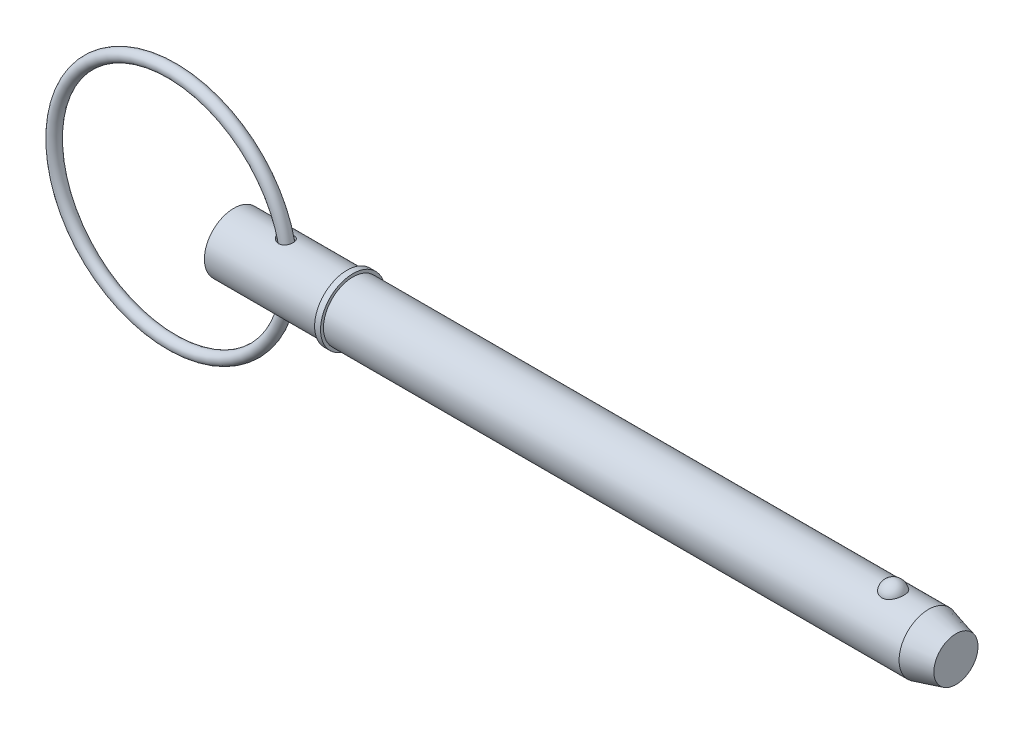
ISO-10303-21;
HEADER;
FILE_DESCRIPTION(('STEP AP214'),'2;1');
FILE_NAME('part.step','',(''),(''),'','','');
FILE_SCHEMA(('AUTOMOTIVE_DESIGN { 1 0 10303 214 1 1 1 1 }'));
ENDSEC;
DATA;
#1=APPLICATION_CONTEXT('core data for automotive mechanical design processes');
#2=APPLICATION_PROTOCOL_DEFINITION('international standard','automotive_design',2000,#1);
#3=PRODUCT_CONTEXT('',#1,'mechanical');
#4=PRODUCT('Part','Part','',(#3));
#5=PRODUCT_RELATED_PRODUCT_CATEGORY('part','',(#4));
#6=PRODUCT_DEFINITION_FORMATION('','',#4);
#7=PRODUCT_DEFINITION_CONTEXT('part definition',#1,'design');
#8=PRODUCT_DEFINITION('design','',#6,#7);
#9=PRODUCT_DEFINITION_SHAPE('','',#8);
#10=(LENGTH_UNIT() NAMED_UNIT(*) SI_UNIT(.MILLI.,.METRE.));
#11=(NAMED_UNIT(*) PLANE_ANGLE_UNIT() SI_UNIT($,.RADIAN.));
#12=(NAMED_UNIT(*) SI_UNIT($,.STERADIAN.) SOLID_ANGLE_UNIT());
#13=UNCERTAINTY_MEASURE_WITH_UNIT(LENGTH_MEASURE(1.E-05),#10,'distance_accuracy_value','');
#14=(GEOMETRIC_REPRESENTATION_CONTEXT(3) GLOBAL_UNCERTAINTY_ASSIGNED_CONTEXT((#13)) GLOBAL_UNIT_ASSIGNED_CONTEXT((#10,
#11,#12)) REPRESENTATION_CONTEXT('',''));
#15=CARTESIAN_POINT('',(0.,0.,0.));
#16=DIRECTION('',(0.,0.,1.));
#17=DIRECTION('',(1.,0.,0.));
#18=AXIS2_PLACEMENT_3D('',#15,#16,#17);
#19=CARTESIAN_POINT('',(-13.3798047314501,0.,0.));
#20=DIRECTION('',(0.,0.,1.));
#21=DIRECTION('',(1.,0.,0.));
#22=AXIS2_PLACEMENT_3D('',#19,#20,#21);
#23=TOROIDAL_SURFACE('',#22,25.4,1.27);
#24=CARTESIAN_POINT('',(13.2901952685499,0.,0.));
#25=VERTEX_POINT('',#24);
#26=VERTEX_LOOP('',#25);
#27=FACE_BOUND('',#26,.T.);
#28=ADVANCED_FACE('P0_F12',(#27),#23,.T.);
#29=CLOSED_SHELL('',(#28));
#30=MANIFOLD_SOLID_BREP('P0_B1',#29);
#31=CARTESIAN_POINT('',(0.,0.,0.));
#32=DIRECTION('',(1.,0.,0.));
#33=DIRECTION('',(0.,0.,-1.));
#34=AXIS2_PLACEMENT_3D('',#31,#32,#33);
#35=CYLINDRICAL_SURFACE('',#34,6.35);
#36=CARTESIAN_POINT('',(9.67500140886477,6.32698634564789,-0.540133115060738));
#37=CARTESIAN_POINT('',(9.70878953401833,6.3197498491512,-0.624879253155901));
#38=CARTESIAN_POINT('',(9.75028044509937,6.31105328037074,-0.706504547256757));
#39=CARTESIAN_POINT('',(9.84659255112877,6.29180070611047,-0.861319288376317));
#40=CARTESIAN_POINT('',(9.90144039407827,6.28124099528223,-0.934491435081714));
#41=CARTESIAN_POINT('',(10.021999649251,6.25949497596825,-1.0704877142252));
#42=CARTESIAN_POINT('',(10.0876589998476,6.2483118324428,-1.1333586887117));
#43=CARTESIAN_POINT('',(10.2280180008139,6.22641783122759,-1.24805262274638));
#44=CARTESIAN_POINT('',(10.3027159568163,6.21570688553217,-1.29987764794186));
#45=CARTESIAN_POINT('',(10.4650889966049,6.19509606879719,-1.39492899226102));
#46=CARTESIAN_POINT('',(10.5533142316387,6.1853135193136,-1.4372443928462));
#47=CARTESIAN_POINT('',(10.7357818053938,6.16871128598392,-1.50691441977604));
#48=CARTESIAN_POINT('',(10.8300253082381,6.16189217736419,-1.53426614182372));
#49=CARTESIAN_POINT('',(11.0227953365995,6.15211299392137,-1.57302798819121));
#50=CARTESIAN_POINT('',(11.1213511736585,6.14918579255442,-1.58430237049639));
#51=CARTESIAN_POINT('',(11.3189518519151,6.1478413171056,-1.58951619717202));
#52=CARTESIAN_POINT('',(11.417996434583,6.14942187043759,-1.58346399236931));
#53=CARTESIAN_POINT('',(11.6070859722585,6.15678569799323,-1.55457003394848));
#54=CARTESIAN_POINT('',(11.6973059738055,6.16229943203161,-1.53280404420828));
#55=CARTESIAN_POINT('',(11.8723373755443,6.176630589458,-1.4739892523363));
#56=CARTESIAN_POINT('',(11.9571502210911,6.185447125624,-1.43694455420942));
#57=CARTESIAN_POINT('',(12.1146737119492,6.20482821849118,-1.3507217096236));
#58=CARTESIAN_POINT('',(12.1877743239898,6.21528554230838,-1.30222952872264));
#59=CARTESIAN_POINT('',(12.324618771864,6.23705116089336,-1.19362916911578));
#60=CARTESIAN_POINT('',(12.3883628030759,6.24835943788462,-1.1335212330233));
#61=CARTESIAN_POINT('',(12.5046662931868,6.27053957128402,-1.00357204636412));
#62=CARTESIAN_POINT('',(12.5572571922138,6.28141258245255,-0.933759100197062));
#63=CARTESIAN_POINT('',(12.6502125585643,6.30157953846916,-0.786214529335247));
#64=CARTESIAN_POINT('',(12.6905764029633,6.31087340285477,-0.708482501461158));
#65=CARTESIAN_POINT('',(12.7585531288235,6.32699259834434,-0.546246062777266));
#66=CARTESIAN_POINT('',(12.7860022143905,6.33378599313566,-0.461669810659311));
#67=CARTESIAN_POINT('',(12.8267605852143,6.34401050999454,-0.288980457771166));
#68=CARTESIAN_POINT('',(12.8400695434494,6.34744155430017,-0.200867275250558));
#69=CARTESIAN_POINT('',(12.8522644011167,6.35058177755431,-0.0231943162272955));
#70=CARTESIAN_POINT('',(12.8510870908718,6.35027464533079,0.0663700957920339));
#71=CARTESIAN_POINT('',(12.8341831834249,6.34593169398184,0.244024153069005));
#72=CARTESIAN_POINT('',(12.8184563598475,6.341895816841,0.332113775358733));
#73=CARTESIAN_POINT('',(12.7728208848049,6.33052992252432,0.504322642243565));
#74=CARTESIAN_POINT('',(12.7429114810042,6.32319973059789,0.588441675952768));
#75=CARTESIAN_POINT('',(12.6696162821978,6.30604116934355,0.750316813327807));
#76=CARTESIAN_POINT('',(12.6262302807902,6.29621276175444,0.828072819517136));
#77=CARTESIAN_POINT('',(12.5270856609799,6.27515240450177,0.974918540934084));
#78=CARTESIAN_POINT('',(12.4713403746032,6.26392197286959,1.04401746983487));
#79=CARTESIAN_POINT('',(12.3488662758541,6.24131002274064,1.1716478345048));
#80=CARTESIAN_POINT('',(12.2821384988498,6.22992851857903,1.23018026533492));
#81=CARTESIAN_POINT('',(12.1401870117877,6.20841765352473,1.33449214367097));
#82=CARTESIAN_POINT('',(12.0650507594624,6.19827734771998,1.38038832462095));
#83=CARTESIAN_POINT('',(11.9079044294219,6.18026478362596,1.45892404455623));
#84=CARTESIAN_POINT('',(11.8258951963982,6.17239224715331,1.49156520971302));
#85=CARTESIAN_POINT('',(11.6581736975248,6.15982613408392,1.54263810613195));
#86=CARTESIAN_POINT('',(11.572502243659,6.15510409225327,1.56119728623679));
#87=CARTESIAN_POINT('',(11.3991899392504,6.14916283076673,1.58443707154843));
#88=CARTESIAN_POINT('',(11.3115488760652,6.14794399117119,1.58911617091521));
#89=CARTESIAN_POINT('',(11.1345547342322,6.14904466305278,1.58485137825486));
#90=CARTESIAN_POINT('',(11.0452104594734,6.15144894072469,1.5755811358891));
#91=CARTESIAN_POINT('',(10.8691479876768,6.15957601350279,1.54349959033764));
#92=CARTESIAN_POINT('',(10.782430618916,6.16529984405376,1.52068406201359));
#93=CARTESIAN_POINT('',(10.6082848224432,6.17983892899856,1.4605156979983));
#94=CARTESIAN_POINT('',(10.5211557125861,6.1888262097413,1.42233764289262));
#95=CARTESIAN_POINT('',(10.3542377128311,6.20874782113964,1.33268652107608));
#96=CARTESIAN_POINT('',(10.2744521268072,6.21968302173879,1.28120750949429));
#97=CARTESIAN_POINT('',(10.120854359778,6.24282707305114,1.16334748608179));
#98=CARTESIAN_POINT('',(10.0474902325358,6.25507146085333,1.09638652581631));
#99=CARTESIAN_POINT('',(9.91368693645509,6.27890019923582,0.950453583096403));
#100=CARTESIAN_POINT('',(9.85324511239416,6.29048468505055,0.87148407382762));
#101=CARTESIAN_POINT('',(9.75037543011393,6.31102161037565,0.707140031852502));
#102=CARTESIAN_POINT('',(9.70726585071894,6.32006820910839,0.622206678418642));
#103=CARTESIAN_POINT('',(9.63775895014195,6.33497125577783,0.445490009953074));
#104=CARTESIAN_POINT('',(9.61134627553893,6.34083063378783,0.35371307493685));
#105=CARTESIAN_POINT('',(9.57891955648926,6.34807071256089,0.177220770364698));
#106=CARTESIAN_POINT('',(9.5709352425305,6.3498832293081,0.0928817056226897));
#107=CARTESIAN_POINT('',(9.56994851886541,6.35010532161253,-0.0758268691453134));
#108=CARTESIAN_POINT('',(9.57692695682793,6.34851924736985,-0.160196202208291));
#109=CARTESIAN_POINT('',(9.59985709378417,6.34339435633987,-0.294043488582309));
#110=CARTESIAN_POINT('',(9.61128951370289,6.34084912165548,-0.34438537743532));
#111=CARTESIAN_POINT('',(9.63933183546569,6.33468615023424,-0.443526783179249));
#112=CARTESIAN_POINT('',(9.65594100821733,6.33106856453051,-0.492326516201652));
#113=CARTESIAN_POINT('',(9.67500140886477,6.32698634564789,-0.540133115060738));
#114=B_SPLINE_CURVE_WITH_KNOTS('',3,(#36,#37,#38,#39,#40,#41,#42,#43,#44,#45,#46,#47,#48,#49,
#50,#51,#52,#53,#54,#55,#56,#57,#58,#59,#60,#61,#62,#63,#64,#65,#66,#67,#68,#69,#70,#71,#72,#73,
#74,#75,#76,#77,#78,#79,#80,#81,#82,#83,#84,#85,#86,#87,#88,#89,#90,#91,#92,#93,#94,#95,#96,#97,
#98,#99,#100,#101,#102,#103,#104,#105,#106,#107,#108,#109,#110,#111,#112,#113),.UNSPECIFIED.,
.T.,.F.,(4,2,2,2,2,2,2,2,2,2,2,2,2,2,2,2,2,2,2,2,2,2,2,2,2,2,2,2,2,2,2,2,2,2,2,2,2,2,4),(0.,
0.274348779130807,0.54924945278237,0.822863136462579,1.09642560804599,1.3900770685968,
1.68378550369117,1.97995934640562,2.27599046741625,2.55347281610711,2.83088067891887,
3.09465189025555,3.35841759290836,3.62142956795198,3.88445494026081,4.1507318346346,
4.4170148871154,4.68446025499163,4.95190978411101,5.21937350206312,5.48684131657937,
5.75402200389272,6.02117751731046,6.28577524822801,6.55034050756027,6.81248178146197,
7.0746514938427,7.34305086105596,7.61153399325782,7.89692981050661,8.18245340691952,
8.48120635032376,8.77989784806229,9.06530254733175,9.35044442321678,9.60331609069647,
9.85586427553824,10.010650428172,10.1654147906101),.UNSPECIFIED.);
#115=CARTESIAN_POINT('',(9.67500140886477,6.32698634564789,-0.540133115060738));
#116=VERTEX_POINT('',#115);
#117=EDGE_CURVE('P1_E42',#116,#116,#114,.T.);
#118=ORIENTED_EDGE('',*,*,#117,.T.);
#119=EDGE_LOOP('',(#118));
#120=FACE_BOUND('',#119,.T.);
#121=CARTESIAN_POINT('',(0.,0.,0.));
#122=DIRECTION('',(1.,0.,0.));
#123=DIRECTION('',(0.,0.,-1.));
#124=AXIS2_PLACEMENT_3D('',#121,#122,#123);
#125=CIRCLE('',#124,6.35);
#126=CARTESIAN_POINT('',(0.,0.,-6.35));
#127=VERTEX_POINT('',#126);
#128=EDGE_CURVE('P1_E9',#127,#127,#125,.T.);
#129=ORIENTED_EDGE('',*,*,#128,.T.);
#130=EDGE_LOOP('',(#129));
#131=FACE_BOUND('',#130,.T.);
#132=CARTESIAN_POINT('',(24.43,0.,0.));
#133=DIRECTION('',(1.,0.,0.));
#134=DIRECTION('',(0.,0.,-1.));
#135=AXIS2_PLACEMENT_3D('',#132,#133,#134);
#136=CIRCLE('',#135,6.35);
#137=CARTESIAN_POINT('',(24.43,0.,-6.35));
#138=VERTEX_POINT('',#137);
#139=EDGE_CURVE('P1_E25',#138,#138,#136,.T.);
#140=ORIENTED_EDGE('',*,*,#139,.F.);
#141=EDGE_LOOP('',(#140));
#142=FACE_BOUND('',#141,.T.);
#143=CARTESIAN_POINT('',(9.67500140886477,-6.32698634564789,-0.540133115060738));
#144=CARTESIAN_POINT('',(9.64544894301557,-6.33331515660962,-0.46600258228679));
#145=CARTESIAN_POINT('',(9.62177180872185,-6.33852974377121,-0.389437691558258));
#146=CARTESIAN_POINT('',(9.58727043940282,-6.34619174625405,-0.233330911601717));
#147=CARTESIAN_POINT('',(9.57644043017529,-6.34864040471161,-0.153790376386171));
#148=CARTESIAN_POINT('',(9.56819517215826,-6.3505010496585,0.00612071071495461));
#149=CARTESIAN_POINT('',(9.57079639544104,-6.34990930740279,0.0864921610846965));
#150=CARTESIAN_POINT('',(9.58930797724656,-6.3457478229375,0.245607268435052));
#151=CARTESIAN_POINT('',(9.60522046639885,-6.34217760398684,0.324350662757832));
#152=CARTESIAN_POINT('',(9.64931570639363,-6.3324977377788,0.47727605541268));
#153=CARTESIAN_POINT('',(9.67737525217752,-6.32641361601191,0.551495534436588));
#154=CARTESIAN_POINT('',(9.74451510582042,-6.31231128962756,0.69455132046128));
#155=CARTESIAN_POINT('',(9.78359827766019,-6.30429258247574,0.763386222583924));
#156=CARTESIAN_POINT('',(9.87474700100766,-6.28638332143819,0.899414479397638));
#157=CARTESIAN_POINT('',(9.92757481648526,-6.27639669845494,0.966083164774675));
#158=CARTESIAN_POINT('',(10.042675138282,-6.25596164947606,1.09061181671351));
#159=CARTESIAN_POINT('',(10.1049521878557,-6.24551300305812,1.14846751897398));
#160=CARTESIAN_POINT('',(10.2445505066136,-6.22397505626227,1.26024641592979));
#161=CARTESIAN_POINT('',(10.3227711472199,-6.2129394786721,1.31305951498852));
#162=CARTESIAN_POINT('',(10.4867924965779,-6.19263757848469,1.40570084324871));
#163=CARTESIAN_POINT('',(10.5725962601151,-6.18337197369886,1.44552380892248));
#164=CARTESIAN_POINT('',(10.7543302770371,-6.16725983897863,1.51283687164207));
#165=CARTESIAN_POINT('',(10.8505554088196,-6.16056505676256,1.53957358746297));
#166=CARTESIAN_POINT('',(11.0463546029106,-6.15127671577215,1.57628137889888));
#167=CARTESIAN_POINT('',(11.1459276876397,-6.14868197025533,1.58625730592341));
#168=CARTESIAN_POINT('',(11.3414257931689,-6.14810798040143,1.58848000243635));
#169=CARTESIAN_POINT('',(11.4373417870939,-6.14995283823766,1.58140242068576));
#170=CARTESIAN_POINT('',(11.6262783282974,-6.1577972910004,1.55057566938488));
#171=CARTESIAN_POINT('',(11.719300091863,-6.16379511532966,1.52683360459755));
#172=CARTESIAN_POINT('',(11.8934223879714,-6.17873566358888,1.46514575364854));
#173=CARTESIAN_POINT('',(11.9749048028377,-6.18746207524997,1.42822144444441));
#174=CARTESIAN_POINT('',(12.1301362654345,-6.20693584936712,1.34105645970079));
#175=CARTESIAN_POINT('',(12.2038861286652,-6.21768299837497,1.29081719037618));
#176=CARTESIAN_POINT('',(12.3399792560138,-6.23970077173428,1.17972764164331));
#177=CARTESIAN_POINT('',(12.4025430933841,-6.25095401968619,1.11914355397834));
#178=CARTESIAN_POINT('',(12.5166805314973,-6.27296916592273,0.988307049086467));
#179=CARTESIAN_POINT('',(12.568253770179,-6.28373104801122,0.918054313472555));
#180=CARTESIAN_POINT('',(12.6596230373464,-6.3037060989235,0.769081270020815));
#181=CARTESIAN_POINT('',(12.6992956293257,-6.31290263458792,0.690283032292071));
#182=CARTESIAN_POINT('',(12.7652258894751,-6.32862394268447,0.527011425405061));
#183=CARTESIAN_POINT('',(12.7914829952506,-6.33514860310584,0.442537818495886));
#184=CARTESIAN_POINT('',(12.8301436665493,-6.34487485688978,0.269505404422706));
#185=CARTESIAN_POINT('',(12.8424230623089,-6.34804664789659,0.180917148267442));
#186=CARTESIAN_POINT('',(12.8524214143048,-6.35062347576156,0.00286829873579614));
#187=CARTESIAN_POINT('',(12.8501402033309,-6.35002846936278,-0.0865923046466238));
#188=CARTESIAN_POINT('',(12.8310619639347,-6.34513332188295,-0.263931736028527));
#189=CARTESIAN_POINT('',(12.8142517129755,-6.34082980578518,-0.35180904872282));
#190=CARTESIAN_POINT('',(12.7664911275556,-6.32897674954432,-0.523406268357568));
#191=CARTESIAN_POINT('',(12.7355404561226,-6.3214271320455,-0.607126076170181));
#192=CARTESIAN_POINT('',(12.6602298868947,-6.30390232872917,-0.768030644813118));
#193=CARTESIAN_POINT('',(12.6158695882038,-6.29392707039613,-0.845215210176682));
#194=CARTESIAN_POINT('',(12.5148171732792,-6.2726521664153,-0.990836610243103));
#195=CARTESIAN_POINT('',(12.4581254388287,-6.26135256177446,-1.05927371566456));
#196=CARTESIAN_POINT('',(12.33416419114,-6.2387572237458,-1.18510935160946));
#197=CARTESIAN_POINT('',(12.2669484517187,-6.22746174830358,-1.24256086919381));
#198=CARTESIAN_POINT('',(12.1235592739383,-6.20610255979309,-1.34519464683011));
#199=CARTESIAN_POINT('',(12.0473871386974,-6.19603866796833,-1.39037868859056));
#200=CARTESIAN_POINT('',(11.8892714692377,-6.17839642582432,-1.46678006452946));
#201=CARTESIAN_POINT('',(11.8074126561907,-6.17078838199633,-1.49816605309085));
#202=CARTESIAN_POINT('',(11.6394563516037,-6.15869606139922,-1.54712759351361));
#203=CARTESIAN_POINT('',(11.5533589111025,-6.15421174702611,-1.56470331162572));
#204=CARTESIAN_POINT('',(11.3789660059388,-6.14876652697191,-1.58596734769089));
#205=CARTESIAN_POINT('',(11.2906621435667,-6.1478222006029,-1.58959032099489));
#206=CARTESIAN_POINT('',(11.1146029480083,-6.149490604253,-1.58312110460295));
#207=CARTESIAN_POINT('',(11.0268477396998,-6.1521041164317,-1.57302589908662));
#208=CARTESIAN_POINT('',(10.8498668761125,-6.16071031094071,-1.53898332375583));
#209=CARTESIAN_POINT('',(10.7607726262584,-6.16685908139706,-1.51439468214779));
#210=CARTESIAN_POINT('',(10.5876521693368,-6.18189031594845,-1.45181305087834));
#211=CARTESIAN_POINT('',(10.5036282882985,-6.19077402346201,-1.41381396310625));
#212=CARTESIAN_POINT('',(10.3374228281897,-6.2109378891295,-1.32252480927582));
#213=CARTESIAN_POINT('',(10.255708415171,-6.2223355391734,-1.26840756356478));
#214=CARTESIAN_POINT('',(10.1025645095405,-6.24580740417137,-1.14725208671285));
#215=CARTESIAN_POINT('',(10.0311354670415,-6.25788164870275,-1.08021329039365));
#216=CARTESIAN_POINT('',(9.90472699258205,-6.2806176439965,-0.938710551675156));
#217=CARTESIAN_POINT('',(9.84904456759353,-6.29132066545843,-0.864883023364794));
#218=CARTESIAN_POINT('',(9.75129345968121,-6.31084098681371,-0.708496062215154));
#219=CARTESIAN_POINT('',(9.70921094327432,-6.31966019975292,-0.625945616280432));
#220=CARTESIAN_POINT('',(9.67500140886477,-6.32698634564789,-0.540133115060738));
#221=B_SPLINE_CURVE_WITH_KNOTS('',3,(#143,#144,#145,#146,#147,#148,#149,#150,#151,#152,#153,
#154,#155,#156,#157,#158,#159,#160,#161,#162,#163,#164,#165,#166,#167,#168,#169,#170,#171,#172,
#173,#174,#175,#176,#177,#178,#179,#180,#181,#182,#183,#184,#185,#186,#187,#188,#189,#190,#191,
#192,#193,#194,#195,#196,#197,#198,#199,#200,#201,#202,#203,#204,#205,#206,#207,#208,#209,#210,
#211,#212,#213,#214,#215,#216,#217,#218,#219,#220),.UNSPECIFIED.,.T.,.F.,(4,2,2,2,2,2,2,2,2,2,2,
2,2,2,2,2,2,2,2,2,2,2,2,2,2,2,2,2,2,2,2,2,2,2,2,2,2,2,4),(0.,0.239871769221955,
0.479635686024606,0.719693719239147,0.959790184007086,1.19750645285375,1.43528453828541,
1.69117930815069,1.94719750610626,2.23102979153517,2.51497694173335,2.81376497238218,
3.11246650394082,3.39952951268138,3.68647020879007,3.95479420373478,4.22308987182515,
4.48530700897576,4.74753278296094,5.01239119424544,5.27726070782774,5.54446524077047,
5.81167284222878,6.07912387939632,6.34658129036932,6.61404669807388,6.88150382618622,
7.1476364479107,7.41373039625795,7.67647472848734,7.93921589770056,8.20318607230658,
8.46721428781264,8.74390821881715,9.02072813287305,9.31537622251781,9.61003720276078,
9.88799314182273,10.1656654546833),.UNSPECIFIED.);
#222=CARTESIAN_POINT('',(9.67500140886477,-6.32698634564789,-0.540133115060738));
#223=VERTEX_POINT('',#222);
#224=EDGE_CURVE('P1_E17',#223,#223,#221,.T.);
#225=ORIENTED_EDGE('',*,*,#224,.T.);
#226=EDGE_LOOP('',(#225));
#227=FACE_BOUND('',#226,.T.);
#228=ADVANCED_FACE('P1_F13',(#120,#131,#142,#227),#35,.T.);
#229=CARTESIAN_POINT('',(0.,0.,0.));
#230=DIRECTION('',(1.,0.,0.));
#231=DIRECTION('',(0.,0.,-1.));
#232=AXIS2_PLACEMENT_3D('',#229,#230,#231);
#233=CYLINDRICAL_SURFACE('',#232,6.35);
#234=CARTESIAN_POINT('',(149.955369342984,0.,0.));
#235=DIRECTION('',(1.,0.,0.));
#236=DIRECTION('',(0.,0.,-1.));
#237=AXIS2_PLACEMENT_3D('',#234,#235,#236);
#238=CIRCLE('',#237,6.35);
#239=CARTESIAN_POINT('',(149.955369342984,0.,-6.35));
#240=VERTEX_POINT('',#239);
#241=EDGE_CURVE('P1_E99',#240,#240,#238,.T.);
#242=ORIENTED_EDGE('',*,*,#241,.F.);
#243=EDGE_LOOP('',(#242));
#244=FACE_BOUND('',#243,.T.);
#245=CARTESIAN_POINT('',(25.7,0.,0.));
#246=DIRECTION('',(1.,0.,0.));
#247=DIRECTION('',(0.,0.,-1.));
#248=AXIS2_PLACEMENT_3D('',#245,#246,#247);
#249=CIRCLE('',#248,6.35);
#250=CARTESIAN_POINT('',(25.7,0.,-6.35));
#251=VERTEX_POINT('',#250);
#252=EDGE_CURVE('P1_E96',#251,#251,#249,.T.);
#253=ORIENTED_EDGE('',*,*,#252,.T.);
#254=EDGE_LOOP('',(#253));
#255=FACE_BOUND('',#254,.T.);
#256=CARTESIAN_POINT('',(142.330021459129,5.87502187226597,2.40969251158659));
#257=CARTESIAN_POINT('',(142.205030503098,5.87501645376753,2.40969773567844));
#258=CARTESIAN_POINT('',(142.080080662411,5.87916061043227,2.39967292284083));
#259=CARTESIAN_POINT('',(141.833909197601,5.8952311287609,2.35991730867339));
#260=CARTESIAN_POINT('',(141.712686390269,5.90715499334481,2.33019283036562));
#261=CARTESIAN_POINT('',(141.477517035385,5.93739567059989,2.25201402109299));
#262=CARTESIAN_POINT('',(141.363560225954,5.95570321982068,2.20358681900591));
#263=CARTESIAN_POINT('',(141.14557352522,5.99672067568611,2.08937987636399));
#264=CARTESIAN_POINT('',(141.041545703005,6.01943149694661,2.02359652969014));
#265=CARTESIAN_POINT('',(140.842943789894,6.06760647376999,1.87428969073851));
#266=CARTESIAN_POINT('',(140.748726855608,6.09313095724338,1.79031110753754));
#267=CARTESIAN_POINT('',(140.575255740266,6.14375873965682,1.60800178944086));
#268=CARTESIAN_POINT('',(140.496004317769,6.16886196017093,1.50966841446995));
#269=CARTESIAN_POINT('',(140.350845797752,6.21724600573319,1.29645884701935));
#270=CARTESIAN_POINT('',(140.285688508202,6.24039621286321,1.18104158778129));
#271=CARTESIAN_POINT('',(140.174703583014,6.28117277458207,0.940351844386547));
#272=CARTESIAN_POINT('',(140.128877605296,6.29879865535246,0.815078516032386));
#273=CARTESIAN_POINT('',(140.057023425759,6.32692073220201,0.556494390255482));
#274=CARTESIAN_POINT('',(140.031249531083,6.33732517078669,0.423102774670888));
#275=CARTESIAN_POINT('',(140.000988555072,6.34957673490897,0.153542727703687));
#276=CARTESIAN_POINT('',(139.996500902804,6.35142408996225,0.0173743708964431));
#277=CARTESIAN_POINT('',(140.008865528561,6.34638925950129,-0.253036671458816));
#278=CARTESIAN_POINT('',(140.025594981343,6.33955731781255,-0.38728593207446));
#279=CARTESIAN_POINT('',(140.079843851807,6.31794129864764,-0.650851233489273));
#280=CARTESIAN_POINT('',(140.117363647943,6.30315707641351,-0.780167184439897));
#281=CARTESIAN_POINT('',(140.212500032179,6.26711642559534,-1.03041949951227));
#282=CARTESIAN_POINT('',(140.270143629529,6.24585130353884,-1.1513443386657));
#283=CARTESIAN_POINT('',(140.404352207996,6.19905619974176,-1.38129800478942));
#284=CARTESIAN_POINT('',(140.480918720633,6.17352587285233,-1.49032586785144));
#285=CARTESIAN_POINT('',(140.651753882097,6.12080227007,-1.69393164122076));
#286=CARTESIAN_POINT('',(140.746100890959,6.09360200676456,-1.78844209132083));
#287=CARTESIAN_POINT('',(140.950119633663,6.04070434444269,-1.95970536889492));
#288=CARTESIAN_POINT('',(141.059790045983,6.01500681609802,-2.03645972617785));
#289=CARTESIAN_POINT('',(141.289187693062,5.96867714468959,-2.16845644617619));
#290=CARTESIAN_POINT('',(141.408652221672,5.94794910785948,-2.22412062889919));
#291=CARTESIAN_POINT('',(141.656218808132,5.91340580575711,-2.31440992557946));
#292=CARTESIAN_POINT('',(141.784317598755,5.8995879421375,-2.3490429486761));
#293=CARTESIAN_POINT('',(142.038582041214,5.88111049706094,-2.39491590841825));
#294=CARTESIAN_POINT('',(142.164520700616,5.876025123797,-2.40724512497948));
#295=CARTESIAN_POINT('',(142.416786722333,5.87428980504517,-2.41147867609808));
#296=CARTESIAN_POINT('',(142.543114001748,5.87763817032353,-2.40338710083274));
#297=CARTESIAN_POINT('',(142.788417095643,5.89212921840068,-2.367627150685));
#298=CARTESIAN_POINT('',(142.907499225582,5.90302431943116,-2.34058030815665));
#299=CARTESIAN_POINT('',(143.13924472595,5.93113752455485,-2.26839066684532));
#300=CARTESIAN_POINT('',(143.251907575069,5.94835614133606,-2.22324640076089));
#301=CARTESIAN_POINT('',(143.470400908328,5.98773016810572,-2.11493806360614));
#302=CARTESIAN_POINT('',(143.576028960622,6.00998499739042,-2.05140269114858));
#303=CARTESIAN_POINT('',(143.775300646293,6.05690144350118,-1.90842705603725));
#304=CARTESIAN_POINT('',(143.868941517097,6.08156361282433,-1.82898313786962));
#305=CARTESIAN_POINT('',(144.046675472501,6.13211715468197,-1.65182429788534));
#306=CARTESIAN_POINT('',(144.130055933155,6.15800825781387,-1.55339381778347));
#307=CARTESIAN_POINT('',(144.279790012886,6.20712834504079,-1.34374214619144));
#308=CARTESIAN_POINT('',(144.346140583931,6.23035685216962,-1.23251867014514));
#309=CARTESIAN_POINT('',(144.462345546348,6.27251177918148,-0.996447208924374));
#310=CARTESIAN_POINT('',(144.511607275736,6.29127762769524,-0.871278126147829));
#311=CARTESIAN_POINT('',(144.589614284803,6.3215862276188,-0.6138701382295));
#312=CARTESIAN_POINT('',(144.618359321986,6.33312889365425,-0.481631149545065));
#313=CARTESIAN_POINT('',(144.65477058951,6.34782349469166,-0.213672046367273));
#314=CARTESIAN_POINT('',(144.662413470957,6.35096613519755,-0.0779482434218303));
#315=CARTESIAN_POINT('',(144.656395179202,6.34851322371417,0.192943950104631));
#316=CARTESIAN_POINT('',(144.642734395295,6.3429178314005,0.328112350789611));
#317=CARTESIAN_POINT('',(144.59450361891,6.32360512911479,0.593406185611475));
#318=CARTESIAN_POINT('',(144.560031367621,6.30992579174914,0.723552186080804));
#319=CARTESIAN_POINT('',(144.470953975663,6.27586325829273,0.97583417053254));
#320=CARTESIAN_POINT('',(144.41634761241,6.25547965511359,1.09796966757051));
#321=CARTESIAN_POINT('',(144.28775879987,6.20998183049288,1.33148921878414));
#322=CARTESIAN_POINT('',(144.213674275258,6.18484288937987,1.44281227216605));
#323=CARTESIAN_POINT('',(144.047820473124,6.13258735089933,1.65087683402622));
#324=CARTESIAN_POINT('',(143.956051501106,6.10547078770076,1.74761859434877));
#325=CARTESIAN_POINT('',(143.757183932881,6.05235879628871,1.92350926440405));
#326=CARTESIAN_POINT('',(143.650133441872,6.0263601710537,2.00271146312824));
#327=CARTESIAN_POINT('',(143.423138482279,5.97843747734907,2.1415415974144));
#328=CARTESIAN_POINT('',(143.303191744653,5.95651412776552,2.20116608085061));
#329=CARTESIAN_POINT('',(143.044523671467,5.91812106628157,2.30250570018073));
#330=CARTESIAN_POINT('',(142.90506980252,5.90217533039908,2.34256795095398));
#331=CARTESIAN_POINT('',(142.620397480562,5.88063128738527,2.39615214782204));
#332=CARTESIAN_POINT('',(142.47518174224,5.8750281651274,2.40968644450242));
#333=CARTESIAN_POINT('',(142.330021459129,5.87502187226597,2.40969251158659));
#334=B_SPLINE_CURVE_WITH_KNOTS('',3,(#256,#257,#258,#259,#260,#261,#262,#263,#264,#265,#266,
#267,#268,#269,#270,#271,#272,#273,#274,#275,#276,#277,#278,#279,#280,#281,#282,#283,#284,#285,
#286,#287,#288,#289,#290,#291,#292,#293,#294,#295,#296,#297,#298,#299,#300,#301,#302,#303,#304,
#305,#306,#307,#308,#309,#310,#311,#312,#313,#314,#315,#316,#317,#318,#319,#320,#321,#322,#323,
#324,#325,#326,#327,#328,#329,#330,#331,#332,#333),.UNSPECIFIED.,.T.,.F.,(4,2,2,2,2,2,2,2,2,2,2,
2,2,2,2,2,2,2,2,2,2,2,2,2,2,2,2,2,2,2,2,2,2,2,2,2,2,2,4),(0.,0.374440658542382,
0.748761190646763,1.12254078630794,1.49639810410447,1.88098871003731,2.2656501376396,
2.66741104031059,3.06920639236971,3.47601794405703,3.88281858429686,4.28727498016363,
4.69173873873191,5.09674745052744,5.50178895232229,5.9086591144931,6.31549420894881,
6.71369855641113,7.11175305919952,7.48978077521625,7.86773278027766,8.23383886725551,
8.59997464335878,8.9740904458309,9.34829231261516,9.7412266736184,10.1342313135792,
10.5397522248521,10.9452779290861,11.3512521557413,11.7572189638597,12.1612938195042,
12.5653932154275,12.9716540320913,13.3779078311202,13.7829098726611,14.1879832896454,
14.6230486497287,15.0579114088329),.UNSPECIFIED.);
#335=CARTESIAN_POINT('',(142.330021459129,5.87502187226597,2.40969251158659));
#336=VERTEX_POINT('',#335);
#337=EDGE_CURVE('P1_E34',#336,#336,#334,.T.);
#338=ORIENTED_EDGE('',*,*,#337,.T.);
#339=EDGE_LOOP('',(#338));
#340=FACE_BOUND('',#339,.T.);
#341=ADVANCED_FACE('P1_F46',(#244,#255,#340),#233,.T.);
#342=CARTESIAN_POINT('',(0.,0.,0.));
#343=DIRECTION('',(-1.,0.,0.));
#344=DIRECTION('',(0.,0.,1.));
#345=AXIS2_PLACEMENT_3D('',#342,#343,#344);
#346=PLANE('',#345);
#347=ORIENTED_EDGE('',*,*,#128,.F.);
#348=EDGE_LOOP('',(#347));
#349=FACE_BOUND('',#348,.T.);
#350=ADVANCED_FACE('P1_F15',(#349),#346,.T.);
#351=CARTESIAN_POINT('',(24.43,6.35,0.));
#352=DIRECTION('',(-1.,0.,0.));
#353=DIRECTION('',(0.,0.,1.));
#354=AXIS2_PLACEMENT_3D('',#351,#352,#353);
#355=PLANE('',#354);
#356=ORIENTED_EDGE('',*,*,#139,.T.);
#357=EDGE_LOOP('',(#356));
#358=FACE_BOUND('',#357,.T.);
#359=CARTESIAN_POINT('',(24.43,0.,0.));
#360=DIRECTION('',(1.,0.,0.));
#361=DIRECTION('',(0.,0.,-1.));
#362=AXIS2_PLACEMENT_3D('',#359,#360,#361);
#363=CIRCLE('',#362,6.985);
#364=CARTESIAN_POINT('',(24.43,0.,-6.985));
#365=VERTEX_POINT('',#364);
#366=EDGE_CURVE('P1_E30',#365,#365,#363,.T.);
#367=ORIENTED_EDGE('',*,*,#366,.F.);
#368=EDGE_LOOP('',(#367));
#369=FACE_BOUND('',#368,.T.);
#370=ADVANCED_FACE('P1_F81',(#358,#369),#355,.T.);
#371=CARTESIAN_POINT('',(0.,0.,0.));
#372=DIRECTION('',(1.,0.,0.));
#373=DIRECTION('',(0.,0.,-1.));
#374=AXIS2_PLACEMENT_3D('',#371,#372,#373);
#375=CYLINDRICAL_SURFACE('',#374,6.985);
#376=ORIENTED_EDGE('',*,*,#366,.T.);
#377=EDGE_LOOP('',(#376));
#378=FACE_BOUND('',#377,.T.);
#379=CARTESIAN_POINT('',(25.7,0.,0.));
#380=DIRECTION('',(1.,0.,0.));
#381=DIRECTION('',(0.,0.,-1.));
#382=AXIS2_PLACEMENT_3D('',#379,#380,#381);
#383=CIRCLE('',#382,6.985);
#384=CARTESIAN_POINT('',(25.7,0.,-6.985));
#385=VERTEX_POINT('',#384);
#386=EDGE_CURVE('P1_E95',#385,#385,#383,.T.);
#387=ORIENTED_EDGE('',*,*,#386,.F.);
#388=EDGE_LOOP('',(#387));
#389=FACE_BOUND('',#388,.T.);
#390=ADVANCED_FACE('P1_F68',(#378,#389),#375,.T.);
#391=CARTESIAN_POINT('',(25.7,6.985,0.));
#392=DIRECTION('',(1.,0.,0.));
#393=DIRECTION('',(0.,0.,-1.));
#394=AXIS2_PLACEMENT_3D('',#391,#392,#393);
#395=PLANE('',#394);
#396=ORIENTED_EDGE('',*,*,#386,.T.);
#397=EDGE_LOOP('',(#396));
#398=FACE_BOUND('',#397,.T.);
#399=ORIENTED_EDGE('',*,*,#252,.F.);
#400=EDGE_LOOP('',(#399));
#401=FACE_BOUND('',#400,.T.);
#402=ADVANCED_FACE('P1_F62',(#398,#401),#395,.T.);
#403=CARTESIAN_POINT('',(155.88,0.,0.));
#404=DIRECTION('',(-1.,0.,0.));
#405=DIRECTION('',(0.,0.,1.));
#406=AXIS2_PLACEMENT_3D('',#403,#404,#405);
#407=CONICAL_SURFACE('',#406,4.76250000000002,0.26179938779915);
#408=ORIENTED_EDGE('',*,*,#241,.T.);
#409=EDGE_LOOP('',(#408));
#410=FACE_BOUND('',#409,.T.);
#411=CARTESIAN_POINT('',(155.88,0.,0.));
#412=DIRECTION('',(1.,0.,0.));
#413=DIRECTION('',(0.,0.,-1.));
#414=AXIS2_PLACEMENT_3D('',#411,#412,#413);
#415=CIRCLE('',#414,4.76250000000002);
#416=CARTESIAN_POINT('',(155.88,0.,-4.76250000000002));
#417=VERTEX_POINT('',#416);
#418=EDGE_CURVE('P1_E41',#417,#417,#415,.T.);
#419=ORIENTED_EDGE('',*,*,#418,.F.);
#420=EDGE_LOOP('',(#419));
#421=FACE_BOUND('',#420,.T.);
#422=ADVANCED_FACE('P1_F59',(#410,#421),#407,.T.);
#423=CARTESIAN_POINT('',(155.88,4.76250000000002,0.));
#424=DIRECTION('',(1.,0.,0.));
#425=DIRECTION('',(0.,0.,-1.));
#426=AXIS2_PLACEMENT_3D('',#423,#424,#425);
#427=PLANE('',#426);
#428=ORIENTED_EDGE('',*,*,#418,.T.);
#429=EDGE_LOOP('',(#428));
#430=FACE_BOUND('',#429,.T.);
#431=ADVANCED_FACE('P1_F55',(#430),#427,.T.);
#432=CARTESIAN_POINT('',(142.330021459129,5.71499999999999,0.));
#433=DIRECTION('',(-1.,0.,0.));
#434=DIRECTION('',(0.,1.,0.));
#435=AXIS2_PLACEMENT_3D('',#432,#433,#434);
#436=SPHERICAL_SURFACE('',#435,2.415);
#437=ORIENTED_EDGE('',*,*,#337,.F.);
#438=EDGE_LOOP('',(#437));
#439=FACE_BOUND('',#438,.T.);
#440=ADVANCED_FACE('P1_F50',(#439),#436,.T.);
#441=CARTESIAN_POINT('',(-13.3798047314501,0.,0.));
#442=DIRECTION('',(0.,0.,1.));
#443=DIRECTION('',(1.,0.,0.));
#444=AXIS2_PLACEMENT_3D('',#441,#442,#443);
#445=TOROIDAL_SURFACE('',#444,25.4,1.5875);
#446=ORIENTED_EDGE('',*,*,#224,.F.);
#447=EDGE_LOOP('',(#446));
#448=FACE_BOUND('',#447,.T.);
#449=ORIENTED_EDGE('',*,*,#117,.F.);
#450=EDGE_LOOP('',(#449));
#451=FACE_BOUND('',#450,.T.);
#452=ADVANCED_FACE('P1_F54',(#448,#451),#445,.F.);
#453=CLOSED_SHELL('',(#228,#341,#350,#370,#390,#402,#422,#431,#440,#452));
#454=MANIFOLD_SOLID_BREP('P1_B1',#453);
#455=ADVANCED_BREP_SHAPE_REPRESENTATION('',(#18,#30,#454),#14);
#456=SHAPE_DEFINITION_REPRESENTATION(#9,#455);
ENDSEC;
END-ISO-10303-21;
